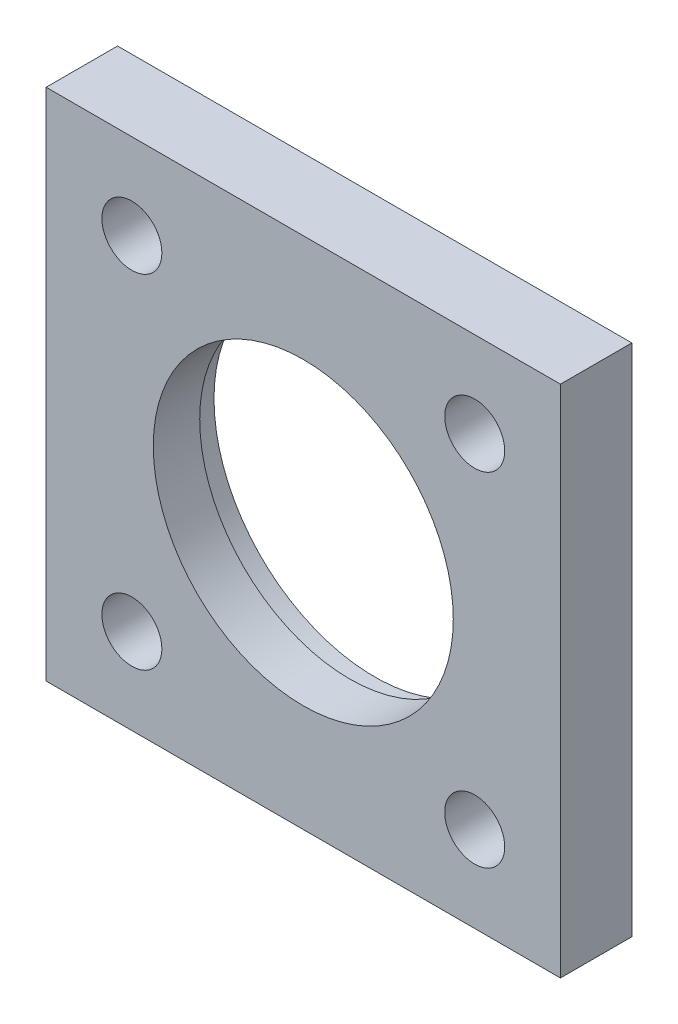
from build123d import *

# Parameters (mm, degrees)
ESQUISSE1_W           = 72
ESQUISSE1_H           = 72
BASE_EXTRUSION_DEPTH  = 10
D_GAGEMENT_POUR_M81_D = 8.4


with BuildPart() as part:
    # Esquisse1 → Base-Extrusion (new body)
    with BuildSketch(Plane.XY):
        Rectangle(ESQUISSE1_W, ESQUISSE1_H)
    extrude(amount=BASE_EXTRUSION_DEPTH)

    # Esquisse3 → Enl_vement de mati_re-R_volution1 (revolve, cut)
    with BuildSketch(Plane(origin=(0, 0, 0), x_dir=(0, 0, -1), z_dir=(1, 0, 0)), mode=Mode.PRIVATE) as enl_vement_de_mati_re_r_volution1_sk:
        Polygon((0, 0), (0, 22.5), (-3.5, 22.5), (-3.5, 21), (-10, 21), (-10, 0), align=None)
    revolve(enl_vement_de_mati_re_r_volution1_sk.sketch.rotate(Axis((0, 0, 0), (0, 0, 1)), 90), axis=Axis((0, 0, 0), (0, 0, 1)), mode=Mode.SUBTRACT)

    # D_gagement pour M81 (through all)
    with Locations(Plane.XY.offset(10)):
        with Locations((-24, 24), (24, -24), (-24, -24), (24, 24)):
            Hole(D_GAGEMENT_POUR_M81_D / 2)


solid = part.part
